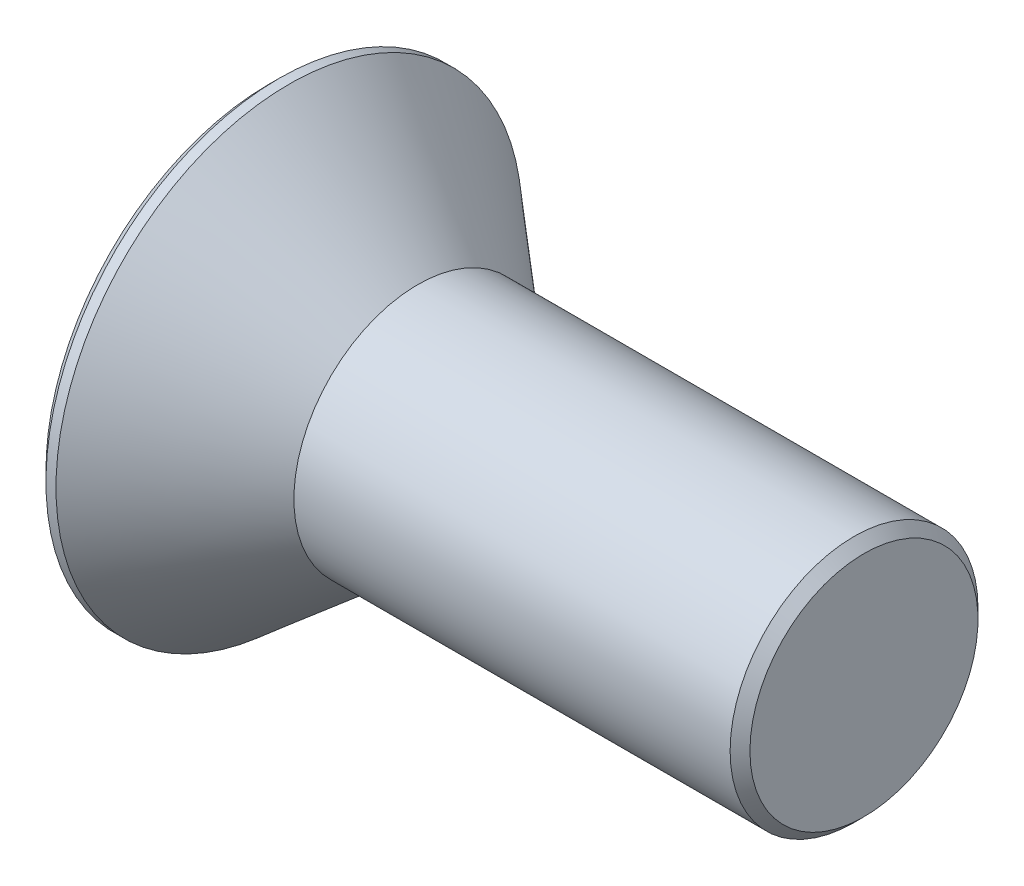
ISO-10303-21;
HEADER;
FILE_DESCRIPTION(('STEP AP214'),'2;1');
FILE_NAME('part.step','',(''),(''),'','','');
FILE_SCHEMA(('AUTOMOTIVE_DESIGN { 1 0 10303 214 1 1 1 1 }'));
ENDSEC;
DATA;
#1=APPLICATION_CONTEXT('core data for automotive mechanical design processes');
#2=APPLICATION_PROTOCOL_DEFINITION('international standard','automotive_design',2000,#1);
#3=PRODUCT_CONTEXT('',#1,'mechanical');
#4=PRODUCT('Part','Part','',(#3));
#5=PRODUCT_RELATED_PRODUCT_CATEGORY('part','',(#4));
#6=PRODUCT_DEFINITION_FORMATION('','',#4);
#7=PRODUCT_DEFINITION_CONTEXT('part definition',#1,'design');
#8=PRODUCT_DEFINITION('design','',#6,#7);
#9=PRODUCT_DEFINITION_SHAPE('','',#8);
#10=(LENGTH_UNIT() NAMED_UNIT(*) SI_UNIT(.MILLI.,.METRE.));
#11=(NAMED_UNIT(*) PLANE_ANGLE_UNIT() SI_UNIT($,.RADIAN.));
#12=(NAMED_UNIT(*) SI_UNIT($,.STERADIAN.) SOLID_ANGLE_UNIT());
#13=UNCERTAINTY_MEASURE_WITH_UNIT(LENGTH_MEASURE(1.E-05),#10,'distance_accuracy_value','');
#14=(GEOMETRIC_REPRESENTATION_CONTEXT(3) GLOBAL_UNCERTAINTY_ASSIGNED_CONTEXT((#13)) GLOBAL_UNIT_ASSIGNED_CONTEXT((#10,
#11,#12)) REPRESENTATION_CONTEXT('',''));
#15=CARTESIAN_POINT('',(0.,0.,0.));
#16=DIRECTION('',(0.,0.,1.));
#17=DIRECTION('',(1.,0.,0.));
#18=AXIS2_PLACEMENT_3D('',#15,#16,#17);
#19=CARTESIAN_POINT('',(1.2,0.,0.));
#20=DIRECTION('',(-1.,0.,0.));
#21=DIRECTION('',(0.,0.,1.));
#22=AXIS2_PLACEMENT_3D('',#19,#20,#21);
#23=PLANE('',#22);
#24=CARTESIAN_POINT('',(1.2,-0.9133974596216,-0.5320508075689));
#25=DIRECTION('',(-1.,0.,0.));
#26=DIRECTION('',(0.,0.,1.));
#27=AXIS2_PLACEMENT_3D('',#24,#25,#26);
#28=CIRCLE('',#27,0.05);
#29=CARTESIAN_POINT('',(1.2,-0.9133974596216,-0.5820508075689));
#30=VERTEX_POINT('',#29);
#31=CARTESIAN_POINT('',(1.2,-0.956698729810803,-0.507050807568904));
#32=VERTEX_POINT('',#31);
#33=EDGE_CURVE('E264',#30,#32,#28,.T.);
#34=ORIENTED_EDGE('',*,*,#33,.T.);
#35=DIRECTION('',(0.,-0.500000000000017,-0.866025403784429));
#36=VECTOR('',#35,1.);
#37=CARTESIAN_POINT('',(1.2,-0.9566987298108,-0.5070508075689));
#38=LINE('',#37,#36);
#39=CARTESIAN_POINT('',(1.2,-0.736121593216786,-0.125000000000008));
#40=VERTEX_POINT('',#39);
#41=EDGE_CURVE('E263',#32,#40,#38,.F.);
#42=ORIENTED_EDGE('',*,*,#41,.T.);
#43=CARTESIAN_POINT('',(1.2,-0.9526279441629,0.));
#44=DIRECTION('',(-1.,0.,0.));
#45=DIRECTION('',(0.,0.,1.));
#46=AXIS2_PLACEMENT_3D('',#43,#44,#45);
#47=CIRCLE('',#46,0.25);
#48=CARTESIAN_POINT('',(1.2,-0.7361215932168,0.125));
#49=VERTEX_POINT('',#48);
#50=EDGE_CURVE('E259',#49,#40,#47,.T.);
#51=ORIENTED_EDGE('',*,*,#50,.F.);
#52=DIRECTION('',(0.,0.500000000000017,-0.866025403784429));
#53=VECTOR('',#52,1.);
#54=CARTESIAN_POINT('',(1.2,-0.7361215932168,0.125));
#55=LINE('',#54,#53);
#56=CARTESIAN_POINT('',(1.2,-0.956698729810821,0.507050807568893));
#57=VERTEX_POINT('',#56);
#58=EDGE_CURVE('E303',#49,#57,#55,.F.);
#59=ORIENTED_EDGE('',*,*,#58,.T.);
#60=CARTESIAN_POINT('',(1.2,-0.9133974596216,0.5320508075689));
#61=DIRECTION('',(-1.,0.,0.));
#62=DIRECTION('',(0.,0.,1.));
#63=AXIS2_PLACEMENT_3D('',#60,#61,#62);
#64=CIRCLE('',#63,0.05);
#65=CARTESIAN_POINT('',(1.2,-0.9133974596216,0.5820508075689));
#66=VERTEX_POINT('',#65);
#67=EDGE_CURVE('E255',#57,#66,#64,.T.);
#68=ORIENTED_EDGE('',*,*,#67,.T.);
#69=DIRECTION('',(0.,1.,0.));
#70=VECTOR('',#69,1.);
#71=CARTESIAN_POINT('',(1.2,-0.9133974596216,0.5820508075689));
#72=LINE('',#71,#70);
#73=CARTESIAN_POINT('',(1.2,-0.4722431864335,0.5820508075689));
#74=VERTEX_POINT('',#73);
#75=EDGE_CURVE('E254',#66,#74,#72,.T.);
#76=ORIENTED_EDGE('',*,*,#75,.T.);
#77=CARTESIAN_POINT('',(1.2,-0.4722431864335,0.8320508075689));
#78=DIRECTION('',(-1.,0.,0.));
#79=DIRECTION('',(0.,0.,1.));
#80=AXIS2_PLACEMENT_3D('',#77,#78,#79);
#81=CIRCLE('',#80,0.25);
#82=CARTESIAN_POINT('',(1.2,-0.2557368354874,0.7070508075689));
#83=VERTEX_POINT('',#82);
#84=EDGE_CURVE('E250',#83,#74,#81,.T.);
#85=ORIENTED_EDGE('',*,*,#84,.F.);
#86=DIRECTION('',(0.,-0.500000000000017,-0.866025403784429));
#87=VECTOR('',#86,1.);
#88=CARTESIAN_POINT('',(1.2,-0.2557368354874,0.7070508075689));
#89=LINE('',#88,#87);
#90=CARTESIAN_POINT('',(1.2,-0.0433012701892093,1.07499999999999));
#91=VERTEX_POINT('',#90);
#92=EDGE_CURVE('E299',#83,#91,#89,.F.);
#93=ORIENTED_EDGE('',*,*,#92,.T.);
#94=CARTESIAN_POINT('',(1.2,0.,1.05));
#95=DIRECTION('',(-1.,0.,0.));
#96=DIRECTION('',(0.,0.,1.));
#97=AXIS2_PLACEMENT_3D('',#94,#95,#96);
#98=CIRCLE('',#97,0.05);
#99=CARTESIAN_POINT('',(1.2,0.04330127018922,1.075));
#100=VERTEX_POINT('',#99);
#101=EDGE_CURVE('E246',#91,#100,#98,.T.);
#102=ORIENTED_EDGE('',*,*,#101,.T.);
#103=DIRECTION('',(0.,-0.500000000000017,0.866025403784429));
#104=VECTOR('',#103,1.);
#105=CARTESIAN_POINT('',(1.2,0.04330127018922,1.075));
#106=LINE('',#105,#104);
#107=CARTESIAN_POINT('',(1.2,0.255736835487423,0.707050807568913));
#108=VERTEX_POINT('',#107);
#109=EDGE_CURVE('E181',#100,#108,#106,.F.);
#110=ORIENTED_EDGE('',*,*,#109,.T.);
#111=CARTESIAN_POINT('',(1.2,0.4722431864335,0.8320508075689));
#112=DIRECTION('',(-1.,0.,0.));
#113=DIRECTION('',(0.,0.,1.));
#114=AXIS2_PLACEMENT_3D('',#111,#112,#113);
#115=CIRCLE('',#114,0.25);
#116=CARTESIAN_POINT('',(1.2,0.4722431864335,0.5820508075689));
#117=VERTEX_POINT('',#116);
#118=EDGE_CURVE('E20',#117,#108,#115,.T.);
#119=ORIENTED_EDGE('',*,*,#118,.F.);
#120=DIRECTION('',(0.,1.,0.));
#121=VECTOR('',#120,1.);
#122=CARTESIAN_POINT('',(1.2,0.4722431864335,0.5820508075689));
#123=LINE('',#122,#121);
#124=CARTESIAN_POINT('',(1.2,0.9133974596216,0.5820508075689));
#125=VERTEX_POINT('',#124);
#126=EDGE_CURVE('E178',#117,#125,#123,.T.);
#127=ORIENTED_EDGE('',*,*,#126,.T.);
#128=CARTESIAN_POINT('',(1.2,0.9133974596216,0.5320508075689));
#129=DIRECTION('',(-1.,0.,0.));
#130=DIRECTION('',(0.,0.,1.));
#131=AXIS2_PLACEMENT_3D('',#128,#129,#130);
#132=CIRCLE('',#131,0.05);
#133=CARTESIAN_POINT('',(1.2,0.956698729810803,0.507050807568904));
#134=VERTEX_POINT('',#133);
#135=EDGE_CURVE('E197',#125,#134,#132,.T.);
#136=ORIENTED_EDGE('',*,*,#135,.T.);
#137=DIRECTION('',(0.,0.500000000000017,0.866025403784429));
#138=VECTOR('',#137,1.);
#139=CARTESIAN_POINT('',(1.2,0.9566987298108,0.5070508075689));
#140=LINE('',#139,#138);
#141=CARTESIAN_POINT('',(1.2,0.736121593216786,0.125000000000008));
#142=VERTEX_POINT('',#141);
#143=EDGE_CURVE('E201',#134,#142,#140,.F.);
#144=ORIENTED_EDGE('',*,*,#143,.T.);
#145=CARTESIAN_POINT('',(1.2,0.9526279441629,0.));
#146=DIRECTION('',(-1.,0.,0.));
#147=DIRECTION('',(0.,0.,1.));
#148=AXIS2_PLACEMENT_3D('',#145,#146,#147);
#149=CIRCLE('',#148,0.25);
#150=CARTESIAN_POINT('',(1.2,0.7361215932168,-0.125));
#151=VERTEX_POINT('',#150);
#152=EDGE_CURVE('E286',#151,#142,#149,.T.);
#153=ORIENTED_EDGE('',*,*,#152,.F.);
#154=DIRECTION('',(0.,-0.500000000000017,0.866025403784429));
#155=VECTOR('',#154,1.);
#156=CARTESIAN_POINT('',(1.2,0.7361215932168,-0.125));
#157=LINE('',#156,#155);
#158=CARTESIAN_POINT('',(1.2,0.956698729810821,-0.507050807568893));
#159=VERTEX_POINT('',#158);
#160=EDGE_CURVE('E314',#151,#159,#157,.F.);
#161=ORIENTED_EDGE('',*,*,#160,.T.);
#162=CARTESIAN_POINT('',(1.2,0.9133974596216,-0.5320508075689));
#163=DIRECTION('',(-1.,0.,0.));
#164=DIRECTION('',(0.,0.,1.));
#165=AXIS2_PLACEMENT_3D('',#162,#163,#164);
#166=CIRCLE('',#165,0.05);
#167=CARTESIAN_POINT('',(1.2,0.9133974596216,-0.5820508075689));
#168=VERTEX_POINT('',#167);
#169=EDGE_CURVE('E282',#159,#168,#166,.T.);
#170=ORIENTED_EDGE('',*,*,#169,.T.);
#171=DIRECTION('',(0.,1.,0.));
#172=VECTOR('',#171,1.);
#173=CARTESIAN_POINT('',(1.2,0.9133974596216,-0.5820508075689));
#174=LINE('',#173,#172);
#175=CARTESIAN_POINT('',(1.2,0.4722431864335,-0.5820508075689));
#176=VERTEX_POINT('',#175);
#177=EDGE_CURVE('E281',#168,#176,#174,.F.);
#178=ORIENTED_EDGE('',*,*,#177,.T.);
#179=CARTESIAN_POINT('',(1.2,0.4722431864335,-0.8320508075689));
#180=DIRECTION('',(-1.,0.,0.));
#181=DIRECTION('',(0.,0.,1.));
#182=AXIS2_PLACEMENT_3D('',#179,#180,#181);
#183=CIRCLE('',#182,0.25);
#184=CARTESIAN_POINT('',(1.2,0.2557368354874,-0.7070508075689));
#185=VERTEX_POINT('',#184);
#186=EDGE_CURVE('E277',#185,#176,#183,.T.);
#187=ORIENTED_EDGE('',*,*,#186,.F.);
#188=DIRECTION('',(0.,0.500000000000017,0.866025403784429));
#189=VECTOR('',#188,1.);
#190=CARTESIAN_POINT('',(1.2,0.2557368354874,-0.7070508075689));
#191=LINE('',#190,#189);
#192=CARTESIAN_POINT('',(1.2,0.0433012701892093,-1.07499999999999));
#193=VERTEX_POINT('',#192);
#194=EDGE_CURVE('E311',#185,#193,#191,.F.);
#195=ORIENTED_EDGE('',*,*,#194,.T.);
#196=CARTESIAN_POINT('',(1.2,0.,-1.05));
#197=DIRECTION('',(-1.,0.,0.));
#198=DIRECTION('',(0.,0.,1.));
#199=AXIS2_PLACEMENT_3D('',#196,#197,#198);
#200=CIRCLE('',#199,0.05);
#201=CARTESIAN_POINT('',(1.2,-0.04330127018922,-1.075));
#202=VERTEX_POINT('',#201);
#203=EDGE_CURVE('E273',#193,#202,#200,.T.);
#204=ORIENTED_EDGE('',*,*,#203,.T.);
#205=DIRECTION('',(0.,0.500000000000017,-0.866025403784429));
#206=VECTOR('',#205,1.);
#207=CARTESIAN_POINT('',(1.2,-0.04330127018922,-1.075));
#208=LINE('',#207,#206);
#209=CARTESIAN_POINT('',(1.2,-0.255736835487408,-0.707050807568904));
#210=VERTEX_POINT('',#209);
#211=EDGE_CURVE('E272',#202,#210,#208,.F.);
#212=ORIENTED_EDGE('',*,*,#211,.T.);
#213=CARTESIAN_POINT('',(1.2,-0.4722431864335,-0.8320508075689));
#214=DIRECTION('',(-1.,0.,0.));
#215=DIRECTION('',(0.,0.,1.));
#216=AXIS2_PLACEMENT_3D('',#213,#214,#215);
#217=CIRCLE('',#216,0.25);
#218=CARTESIAN_POINT('',(1.2,-0.4722431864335,-0.5820508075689));
#219=VERTEX_POINT('',#218);
#220=EDGE_CURVE('E268',#219,#210,#217,.T.);
#221=ORIENTED_EDGE('',*,*,#220,.F.);
#222=DIRECTION('',(0.,1.,0.));
#223=VECTOR('',#222,1.);
#224=CARTESIAN_POINT('',(1.2,-0.4722431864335,-0.5820508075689));
#225=LINE('',#224,#223);
#226=EDGE_CURVE('E307',#219,#30,#225,.F.);
#227=ORIENTED_EDGE('',*,*,#226,.T.);
#228=EDGE_LOOP('',(#34,#42,#51,#59,#68,#76,#85,#93,#102,#110,#119,#127,#136,#144,#153,#161,#170,
#178,#187,#195,#204,#212,#221,#227));
#229=FACE_BOUND('',#228,.T.);
#230=ADVANCED_FACE('F17',(#229),#23,.T.);
#231=CARTESIAN_POINT('',(0.,0.4722431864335,0.8320508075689));
#232=DIRECTION('',(-1.,0.,0.));
#233=DIRECTION('',(0.,0.,1.));
#234=AXIS2_PLACEMENT_3D('',#231,#232,#233);
#235=CYLINDRICAL_SURFACE('',#234,0.25);
#236=ORIENTED_EDGE('',*,*,#118,.T.);
#237=DIRECTION('',(1.,0.,0.));
#238=VECTOR('',#237,1.);
#239=CARTESIAN_POINT('',(0.,0.255736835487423,0.707050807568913));
#240=LINE('',#239,#238);
#241=CARTESIAN_POINT('',(0.,0.255736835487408,0.707050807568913));
#242=VERTEX_POINT('',#241);
#243=EDGE_CURVE('E245',#108,#242,#240,.F.);
#244=ORIENTED_EDGE('',*,*,#243,.T.);
#245=CARTESIAN_POINT('',(0.,0.4722431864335,0.8320508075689));
#246=DIRECTION('',(-1.,0.,0.));
#247=DIRECTION('',(0.,0.,1.));
#248=AXIS2_PLACEMENT_3D('',#245,#246,#247);
#249=CIRCLE('',#248,0.25);
#250=CARTESIAN_POINT('',(0.,0.4722431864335,0.5820508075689));
#251=VERTEX_POINT('',#250);
#252=EDGE_CURVE('E188',#242,#251,#249,.F.);
#253=ORIENTED_EDGE('',*,*,#252,.T.);
#254=DIRECTION('',(1.,0.,0.));
#255=VECTOR('',#254,1.);
#256=CARTESIAN_POINT('',(0.,0.4722431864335,0.5820508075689));
#257=LINE('',#256,#255);
#258=EDGE_CURVE('E184',#251,#117,#257,.T.);
#259=ORIENTED_EDGE('',*,*,#258,.T.);
#260=EDGE_LOOP('',(#236,#244,#253,#259));
#261=FACE_BOUND('',#260,.T.);
#262=ADVANCED_FACE('F186',(#261),#235,.T.);
#263=CARTESIAN_POINT('',(0.,0.4722431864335,0.5820508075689));
#264=DIRECTION('',(0.,0.,1.));
#265=DIRECTION('',(1.,0.,0.));
#266=AXIS2_PLACEMENT_3D('',#263,#264,#265);
#267=PLANE('',#266);
#268=DIRECTION('',(-1.,0.,0.));
#269=VECTOR('',#268,1.);
#270=CARTESIAN_POINT('',(0.,0.9133974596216,0.5820508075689));
#271=LINE('',#270,#269);
#272=CARTESIAN_POINT('',(0.,0.9133974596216,0.5820508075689));
#273=VERTEX_POINT('',#272);
#274=EDGE_CURVE('E194',#273,#125,#271,.F.);
#275=ORIENTED_EDGE('',*,*,#274,.T.);
#276=ORIENTED_EDGE('',*,*,#126,.F.);
#277=ORIENTED_EDGE('',*,*,#258,.F.);
#278=DIRECTION('',(0.,1.,0.));
#279=VECTOR('',#278,1.);
#280=CARTESIAN_POINT('',(0.,0.,0.5820508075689));
#281=LINE('',#280,#279);
#282=EDGE_CURVE('E243',#251,#273,#281,.T.);
#283=ORIENTED_EDGE('',*,*,#282,.T.);
#284=EDGE_LOOP('',(#275,#276,#277,#283));
#285=FACE_BOUND('',#284,.T.);
#286=ADVANCED_FACE('F192',(#285),#267,.F.);
#287=CARTESIAN_POINT('',(0.,0.9133974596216,0.5320508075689));
#288=DIRECTION('',(-1.,0.,0.));
#289=DIRECTION('',(0.,0.,1.));
#290=AXIS2_PLACEMENT_3D('',#287,#288,#289);
#291=CYLINDRICAL_SURFACE('',#290,0.05);
#292=DIRECTION('',(1.,0.,0.));
#293=VECTOR('',#292,1.);
#294=CARTESIAN_POINT('',(0.,0.9566987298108,0.5070508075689));
#295=LINE('',#294,#293);
#296=CARTESIAN_POINT('',(0.,0.956698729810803,0.507050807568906));
#297=VERTEX_POINT('',#296);
#298=EDGE_CURVE('E289',#297,#134,#295,.T.);
#299=ORIENTED_EDGE('',*,*,#298,.T.);
#300=ORIENTED_EDGE('',*,*,#135,.F.);
#301=ORIENTED_EDGE('',*,*,#274,.F.);
#302=CARTESIAN_POINT('',(0.,0.9133974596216,0.5320508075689));
#303=DIRECTION('',(-1.,0.,0.));
#304=DIRECTION('',(0.,0.,1.));
#305=AXIS2_PLACEMENT_3D('',#302,#303,#304);
#306=CIRCLE('',#305,0.05);
#307=EDGE_CURVE('E241',#273,#297,#306,.T.);
#308=ORIENTED_EDGE('',*,*,#307,.T.);
#309=EDGE_LOOP('',(#299,#300,#301,#308));
#310=FACE_BOUND('',#309,.T.);
#311=ADVANCED_FACE('F515',(#310),#291,.F.);
#312=CARTESIAN_POINT('',(0.,0.9566987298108,0.5070508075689));
#313=DIRECTION('',(0.,0.866025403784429,-0.500000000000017));
#314=DIRECTION('',(0.,0.500000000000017,0.866025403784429));
#315=AXIS2_PLACEMENT_3D('',#312,#313,#314);
#316=PLANE('',#315);
#317=DIRECTION('',(-1.,0.,0.));
#318=VECTOR('',#317,1.);
#319=CARTESIAN_POINT('',(0.,0.736121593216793,0.125000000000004));
#320=LINE('',#319,#318);
#321=CARTESIAN_POINT('',(0.,0.736121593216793,0.124999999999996));
#322=VERTEX_POINT('',#321);
#323=EDGE_CURVE('E288',#142,#322,#320,.T.);
#324=ORIENTED_EDGE('',*,*,#323,.F.);
#325=ORIENTED_EDGE('',*,*,#143,.F.);
#326=ORIENTED_EDGE('',*,*,#298,.F.);
#327=DIRECTION('',(0.,-0.499999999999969,-0.866025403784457));
#328=VECTOR('',#327,1.);
#329=CARTESIAN_POINT('',(0.,0.9566987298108,0.5070508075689));
#330=LINE('',#329,#328);
#331=EDGE_CURVE('E240',#297,#322,#330,.T.);
#332=ORIENTED_EDGE('',*,*,#331,.T.);
#333=EDGE_LOOP('',(#324,#325,#326,#332));
#334=FACE_BOUND('',#333,.T.);
#335=ADVANCED_FACE('F512',(#334),#316,.F.);
#336=CARTESIAN_POINT('',(0.,0.9526279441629,0.));
#337=DIRECTION('',(-1.,0.,0.));
#338=DIRECTION('',(0.,0.,1.));
#339=AXIS2_PLACEMENT_3D('',#336,#337,#338);
#340=CYLINDRICAL_SURFACE('',#339,0.25);
#341=ORIENTED_EDGE('',*,*,#152,.T.);
#342=ORIENTED_EDGE('',*,*,#323,.T.);
#343=CARTESIAN_POINT('',(0.,0.9526279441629,0.));
#344=DIRECTION('',(-1.,0.,0.));
#345=DIRECTION('',(0.,0.,1.));
#346=AXIS2_PLACEMENT_3D('',#343,#344,#345);
#347=CIRCLE('',#346,0.25);
#348=CARTESIAN_POINT('',(0.,0.736121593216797,-0.124999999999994));
#349=VERTEX_POINT('',#348);
#350=EDGE_CURVE('E238',#322,#349,#347,.F.);
#351=ORIENTED_EDGE('',*,*,#350,.T.);
#352=DIRECTION('',(1.,0.,0.));
#353=VECTOR('',#352,1.);
#354=CARTESIAN_POINT('',(0.,0.7361215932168,-0.125));
#355=LINE('',#354,#353);
#356=EDGE_CURVE('E315',#349,#151,#355,.T.);
#357=ORIENTED_EDGE('',*,*,#356,.T.);
#358=EDGE_LOOP('',(#341,#342,#351,#357));
#359=FACE_BOUND('',#358,.T.);
#360=ADVANCED_FACE('F508',(#359),#340,.T.);
#361=CARTESIAN_POINT('',(0.,0.7361215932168,-0.125));
#362=DIRECTION('',(0.,0.866025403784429,0.500000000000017));
#363=DIRECTION('',(0.,-0.500000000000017,0.866025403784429));
#364=AXIS2_PLACEMENT_3D('',#361,#362,#363);
#365=PLANE('',#364);
#366=DIRECTION('',(-1.,0.,0.));
#367=VECTOR('',#366,1.);
#368=CARTESIAN_POINT('',(0.,0.956698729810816,-0.50705080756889));
#369=LINE('',#368,#367);
#370=CARTESIAN_POINT('',(0.,0.956698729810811,-0.507050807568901));
#371=VERTEX_POINT('',#370);
#372=EDGE_CURVE('E285',#371,#159,#369,.F.);
#373=ORIENTED_EDGE('',*,*,#372,.T.);
#374=ORIENTED_EDGE('',*,*,#160,.F.);
#375=ORIENTED_EDGE('',*,*,#356,.F.);
#376=DIRECTION('',(0.,0.499999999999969,-0.866025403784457));
#377=VECTOR('',#376,1.);
#378=CARTESIAN_POINT('',(0.,0.7361215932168,-0.125));
#379=LINE('',#378,#377);
#380=EDGE_CURVE('E237',#349,#371,#379,.T.);
#381=ORIENTED_EDGE('',*,*,#380,.T.);
#382=EDGE_LOOP('',(#373,#374,#375,#381));
#383=FACE_BOUND('',#382,.T.);
#384=ADVANCED_FACE('F504',(#383),#365,.F.);
#385=CARTESIAN_POINT('',(0.,0.9133974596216,-0.5320508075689));
#386=DIRECTION('',(-1.,0.,0.));
#387=DIRECTION('',(0.,0.,1.));
#388=AXIS2_PLACEMENT_3D('',#385,#386,#387);
#389=CYLINDRICAL_SURFACE('',#388,0.05);
#390=DIRECTION('',(-1.,0.,0.));
#391=VECTOR('',#390,1.);
#392=CARTESIAN_POINT('',(0.,0.9133974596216,-0.5820508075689));
#393=LINE('',#392,#391);
#394=CARTESIAN_POINT('',(0.,0.9133974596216,-0.5820508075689));
#395=VERTEX_POINT('',#394);
#396=EDGE_CURVE('E284',#395,#168,#393,.F.);
#397=ORIENTED_EDGE('',*,*,#396,.T.);
#398=ORIENTED_EDGE('',*,*,#169,.F.);
#399=ORIENTED_EDGE('',*,*,#372,.F.);
#400=CARTESIAN_POINT('',(0.,0.9133974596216,-0.5320508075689));
#401=DIRECTION('',(-1.,0.,0.));
#402=DIRECTION('',(0.,0.,1.));
#403=AXIS2_PLACEMENT_3D('',#400,#401,#402);
#404=CIRCLE('',#403,0.05);
#405=EDGE_CURVE('E235',#371,#395,#404,.T.);
#406=ORIENTED_EDGE('',*,*,#405,.T.);
#407=EDGE_LOOP('',(#397,#398,#399,#406));
#408=FACE_BOUND('',#407,.T.);
#409=ADVANCED_FACE('F500',(#408),#389,.F.);
#410=CARTESIAN_POINT('',(0.,0.9133974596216,-0.5820508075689));
#411=DIRECTION('',(0.,0.,-1.));
#412=DIRECTION('',(-1.,0.,0.));
#413=AXIS2_PLACEMENT_3D('',#410,#411,#412);
#414=PLANE('',#413);
#415=DIRECTION('',(-1.,0.,0.));
#416=VECTOR('',#415,1.);
#417=CARTESIAN_POINT('',(0.,0.4722431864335,-0.5820508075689));
#418=LINE('',#417,#416);
#419=CARTESIAN_POINT('',(0.,0.4722431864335,-0.5820508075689));
#420=VERTEX_POINT('',#419);
#421=EDGE_CURVE('E280',#176,#420,#418,.T.);
#422=ORIENTED_EDGE('',*,*,#421,.F.);
#423=ORIENTED_EDGE('',*,*,#177,.F.);
#424=ORIENTED_EDGE('',*,*,#396,.F.);
#425=DIRECTION('',(0.,1.,0.));
#426=VECTOR('',#425,1.);
#427=CARTESIAN_POINT('',(0.,0.,-0.5820508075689));
#428=LINE('',#427,#426);
#429=EDGE_CURVE('E234',#395,#420,#428,.F.);
#430=ORIENTED_EDGE('',*,*,#429,.T.);
#431=EDGE_LOOP('',(#422,#423,#424,#430));
#432=FACE_BOUND('',#431,.T.);
#433=ADVANCED_FACE('F496',(#432),#414,.F.);
#434=CARTESIAN_POINT('',(0.,0.4722431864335,-0.8320508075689));
#435=DIRECTION('',(-1.,0.,0.));
#436=DIRECTION('',(0.,0.,1.));
#437=AXIS2_PLACEMENT_3D('',#434,#435,#436);
#438=CYLINDRICAL_SURFACE('',#437,0.25);
#439=ORIENTED_EDGE('',*,*,#186,.T.);
#440=ORIENTED_EDGE('',*,*,#421,.T.);
#441=CARTESIAN_POINT('',(0.,0.4722431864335,-0.8320508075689));
#442=DIRECTION('',(-1.,0.,0.));
#443=DIRECTION('',(0.,0.,1.));
#444=AXIS2_PLACEMENT_3D('',#441,#442,#443);
#445=CIRCLE('',#444,0.25);
#446=CARTESIAN_POINT('',(0.,0.255736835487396,-0.707050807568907));
#447=VERTEX_POINT('',#446);
#448=EDGE_CURVE('E232',#420,#447,#445,.F.);
#449=ORIENTED_EDGE('',*,*,#448,.T.);
#450=DIRECTION('',(1.,0.,0.));
#451=VECTOR('',#450,1.);
#452=CARTESIAN_POINT('',(0.,0.2557368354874,-0.7070508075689));
#453=LINE('',#452,#451);
#454=EDGE_CURVE('E313',#447,#185,#453,.T.);
#455=ORIENTED_EDGE('',*,*,#454,.T.);
#456=EDGE_LOOP('',(#439,#440,#449,#455));
#457=FACE_BOUND('',#456,.T.);
#458=ADVANCED_FACE('F492',(#457),#438,.T.);
#459=CARTESIAN_POINT('',(0.,0.2557368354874,-0.7070508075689));
#460=DIRECTION('',(0.,0.866025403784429,-0.500000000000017));
#461=DIRECTION('',(0.,0.500000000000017,0.866025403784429));
#462=AXIS2_PLACEMENT_3D('',#459,#460,#461);
#463=PLANE('',#462);
#464=DIRECTION('',(-1.,0.,0.));
#465=VECTOR('',#464,1.);
#466=CARTESIAN_POINT('',(0.,0.0433012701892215,-1.075));
#467=LINE('',#466,#465);
#468=CARTESIAN_POINT('',(0.,0.0433012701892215,-1.075));
#469=VERTEX_POINT('',#468);
#470=EDGE_CURVE('E276',#469,#193,#467,.F.);
#471=ORIENTED_EDGE('',*,*,#470,.T.);
#472=ORIENTED_EDGE('',*,*,#194,.F.);
#473=ORIENTED_EDGE('',*,*,#454,.F.);
#474=DIRECTION('',(0.,-0.499999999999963,-0.86602540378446));
#475=VECTOR('',#474,1.);
#476=CARTESIAN_POINT('',(0.,0.2557368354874,-0.7070508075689));
#477=LINE('',#476,#475);
#478=EDGE_CURVE('E231',#447,#469,#477,.T.);
#479=ORIENTED_EDGE('',*,*,#478,.T.);
#480=EDGE_LOOP('',(#471,#472,#473,#479));
#481=FACE_BOUND('',#480,.T.);
#482=ADVANCED_FACE('F488',(#481),#463,.F.);
#483=CARTESIAN_POINT('',(0.,0.,-1.05));
#484=DIRECTION('',(-1.,0.,0.));
#485=DIRECTION('',(0.,0.,1.));
#486=AXIS2_PLACEMENT_3D('',#483,#484,#485);
#487=CYLINDRICAL_SURFACE('',#486,0.05);
#488=DIRECTION('',(1.,0.,0.));
#489=VECTOR('',#488,1.);
#490=CARTESIAN_POINT('',(0.,-0.04330127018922,-1.075));
#491=LINE('',#490,#489);
#492=CARTESIAN_POINT('',(0.,-0.0433012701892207,-1.075));
#493=VERTEX_POINT('',#492);
#494=EDGE_CURVE('E275',#493,#202,#491,.T.);
#495=ORIENTED_EDGE('',*,*,#494,.T.);
#496=ORIENTED_EDGE('',*,*,#203,.F.);
#497=ORIENTED_EDGE('',*,*,#470,.F.);
#498=CARTESIAN_POINT('',(0.,0.,-1.05));
#499=DIRECTION('',(-1.,0.,0.));
#500=DIRECTION('',(0.,0.,1.));
#501=AXIS2_PLACEMENT_3D('',#498,#499,#500);
#502=CIRCLE('',#501,0.05);
#503=EDGE_CURVE('E229',#469,#493,#502,.T.);
#504=ORIENTED_EDGE('',*,*,#503,.T.);
#505=EDGE_LOOP('',(#495,#496,#497,#504));
#506=FACE_BOUND('',#505,.T.);
#507=ADVANCED_FACE('F484',(#506),#487,.F.);
#508=CARTESIAN_POINT('',(0.,-0.04330127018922,-1.075));
#509=DIRECTION('',(0.,-0.866025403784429,-0.500000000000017));
#510=DIRECTION('',(0.,0.500000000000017,-0.866025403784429));
#511=AXIS2_PLACEMENT_3D('',#508,#509,#510);
#512=PLANE('',#511);
#513=DIRECTION('',(-1.,0.,0.));
#514=VECTOR('',#513,1.);
#515=CARTESIAN_POINT('',(0.,-0.255736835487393,-0.707050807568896));
#516=LINE('',#515,#514);
#517=CARTESIAN_POINT('',(0.,-0.255736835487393,-0.707050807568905));
#518=VERTEX_POINT('',#517);
#519=EDGE_CURVE('E271',#210,#518,#516,.T.);
#520=ORIENTED_EDGE('',*,*,#519,.F.);
#521=ORIENTED_EDGE('',*,*,#211,.F.);
#522=ORIENTED_EDGE('',*,*,#494,.F.);
#523=DIRECTION('',(0.,-0.499999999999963,0.86602540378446));
#524=VECTOR('',#523,1.);
#525=CARTESIAN_POINT('',(0.,-0.04330127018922,-1.075));
#526=LINE('',#525,#524);
#527=EDGE_CURVE('E228',#493,#518,#526,.T.);
#528=ORIENTED_EDGE('',*,*,#527,.T.);
#529=EDGE_LOOP('',(#520,#521,#522,#528));
#530=FACE_BOUND('',#529,.T.);
#531=ADVANCED_FACE('F480',(#530),#512,.F.);
#532=CARTESIAN_POINT('',(0.,-0.4722431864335,-0.8320508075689));
#533=DIRECTION('',(-1.,0.,0.));
#534=DIRECTION('',(0.,0.,1.));
#535=AXIS2_PLACEMENT_3D('',#532,#533,#534);
#536=CYLINDRICAL_SURFACE('',#535,0.25);
#537=ORIENTED_EDGE('',*,*,#220,.T.);
#538=ORIENTED_EDGE('',*,*,#519,.T.);
#539=CARTESIAN_POINT('',(0.,-0.4722431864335,-0.8320508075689));
#540=DIRECTION('',(-1.,0.,0.));
#541=DIRECTION('',(0.,0.,1.));
#542=AXIS2_PLACEMENT_3D('',#539,#540,#541);
#543=CIRCLE('',#542,0.25);
#544=CARTESIAN_POINT('',(0.,-0.4722431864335,-0.5820508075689));
#545=VERTEX_POINT('',#544);
#546=EDGE_CURVE('E226',#518,#545,#543,.F.);
#547=ORIENTED_EDGE('',*,*,#546,.T.);
#548=DIRECTION('',(-1.,0.,0.));
#549=VECTOR('',#548,1.);
#550=CARTESIAN_POINT('',(0.,-0.4722431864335,-0.5820508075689));
#551=LINE('',#550,#549);
#552=EDGE_CURVE('E309',#545,#219,#551,.F.);
#553=ORIENTED_EDGE('',*,*,#552,.T.);
#554=EDGE_LOOP('',(#537,#538,#547,#553));
#555=FACE_BOUND('',#554,.T.);
#556=ADVANCED_FACE('F476',(#555),#536,.T.);
#557=CARTESIAN_POINT('',(0.,-0.4722431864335,-0.5820508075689));
#558=DIRECTION('',(0.,0.,-1.));
#559=DIRECTION('',(-1.,0.,0.));
#560=AXIS2_PLACEMENT_3D('',#557,#558,#559);
#561=PLANE('',#560);
#562=DIRECTION('',(-1.,0.,0.));
#563=VECTOR('',#562,1.);
#564=CARTESIAN_POINT('',(0.,-0.9133974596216,-0.5820508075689));
#565=LINE('',#564,#563);
#566=CARTESIAN_POINT('',(0.,-0.9133974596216,-0.5820508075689));
#567=VERTEX_POINT('',#566);
#568=EDGE_CURVE('E267',#567,#30,#565,.F.);
#569=ORIENTED_EDGE('',*,*,#568,.T.);
#570=ORIENTED_EDGE('',*,*,#226,.F.);
#571=ORIENTED_EDGE('',*,*,#552,.F.);
#572=DIRECTION('',(0.,1.,0.));
#573=VECTOR('',#572,1.);
#574=CARTESIAN_POINT('',(0.,0.,-0.5820508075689));
#575=LINE('',#574,#573);
#576=EDGE_CURVE('E225',#545,#567,#575,.F.);
#577=ORIENTED_EDGE('',*,*,#576,.T.);
#578=EDGE_LOOP('',(#569,#570,#571,#577));
#579=FACE_BOUND('',#578,.T.);
#580=ADVANCED_FACE('F472',(#579),#561,.F.);
#581=CARTESIAN_POINT('',(0.,-0.9133974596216,-0.5320508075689));
#582=DIRECTION('',(-1.,0.,0.));
#583=DIRECTION('',(0.,0.,1.));
#584=AXIS2_PLACEMENT_3D('',#581,#582,#583);
#585=CYLINDRICAL_SURFACE('',#584,0.05);
#586=DIRECTION('',(1.,0.,0.));
#587=VECTOR('',#586,1.);
#588=CARTESIAN_POINT('',(0.,-0.9566987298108,-0.5070508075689));
#589=LINE('',#588,#587);
#590=CARTESIAN_POINT('',(0.,-0.956698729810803,-0.507050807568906));
#591=VERTEX_POINT('',#590);
#592=EDGE_CURVE('E266',#591,#32,#589,.T.);
#593=ORIENTED_EDGE('',*,*,#592,.T.);
#594=ORIENTED_EDGE('',*,*,#33,.F.);
#595=ORIENTED_EDGE('',*,*,#568,.F.);
#596=CARTESIAN_POINT('',(0.,-0.9133974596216,-0.5320508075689));
#597=DIRECTION('',(-1.,0.,0.));
#598=DIRECTION('',(0.,0.,1.));
#599=AXIS2_PLACEMENT_3D('',#596,#597,#598);
#600=CIRCLE('',#599,0.05);
#601=EDGE_CURVE('E223',#567,#591,#600,.T.);
#602=ORIENTED_EDGE('',*,*,#601,.T.);
#603=EDGE_LOOP('',(#593,#594,#595,#602));
#604=FACE_BOUND('',#603,.T.);
#605=ADVANCED_FACE('F468',(#604),#585,.F.);
#606=CARTESIAN_POINT('',(0.,-0.9566987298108,-0.5070508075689));
#607=DIRECTION('',(0.,-0.866025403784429,0.500000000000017));
#608=DIRECTION('',(0.,-0.500000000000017,-0.866025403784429));
#609=AXIS2_PLACEMENT_3D('',#606,#607,#608);
#610=PLANE('',#609);
#611=DIRECTION('',(-1.,0.,0.));
#612=VECTOR('',#611,1.);
#613=CARTESIAN_POINT('',(0.,-0.736121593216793,-0.125000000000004));
#614=LINE('',#613,#612);
#615=CARTESIAN_POINT('',(0.,-0.736121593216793,-0.124999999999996));
#616=VERTEX_POINT('',#615);
#617=EDGE_CURVE('E262',#40,#616,#614,.T.);
#618=ORIENTED_EDGE('',*,*,#617,.F.);
#619=ORIENTED_EDGE('',*,*,#41,.F.);
#620=ORIENTED_EDGE('',*,*,#592,.F.);
#621=DIRECTION('',(0.,0.499999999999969,0.866025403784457));
#622=VECTOR('',#621,1.);
#623=CARTESIAN_POINT('',(0.,-0.9566987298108,-0.5070508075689));
#624=LINE('',#623,#622);
#625=EDGE_CURVE('E222',#591,#616,#624,.T.);
#626=ORIENTED_EDGE('',*,*,#625,.T.);
#627=EDGE_LOOP('',(#618,#619,#620,#626));
#628=FACE_BOUND('',#627,.T.);
#629=ADVANCED_FACE('F464',(#628),#610,.F.);
#630=CARTESIAN_POINT('',(0.,-0.9526279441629,0.));
#631=DIRECTION('',(-1.,0.,0.));
#632=DIRECTION('',(0.,0.,1.));
#633=AXIS2_PLACEMENT_3D('',#630,#631,#632);
#634=CYLINDRICAL_SURFACE('',#633,0.25);
#635=ORIENTED_EDGE('',*,*,#50,.T.);
#636=ORIENTED_EDGE('',*,*,#617,.T.);
#637=CARTESIAN_POINT('',(0.,-0.9526279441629,0.));
#638=DIRECTION('',(-1.,0.,0.));
#639=DIRECTION('',(0.,0.,1.));
#640=AXIS2_PLACEMENT_3D('',#637,#638,#639);
#641=CIRCLE('',#640,0.25);
#642=CARTESIAN_POINT('',(0.,-0.736121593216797,0.124999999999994));
#643=VERTEX_POINT('',#642);
#644=EDGE_CURVE('E220',#616,#643,#641,.F.);
#645=ORIENTED_EDGE('',*,*,#644,.T.);
#646=DIRECTION('',(1.,0.,0.));
#647=VECTOR('',#646,1.);
#648=CARTESIAN_POINT('',(0.,-0.7361215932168,0.125));
#649=LINE('',#648,#647);
#650=EDGE_CURVE('E305',#643,#49,#649,.T.);
#651=ORIENTED_EDGE('',*,*,#650,.T.);
#652=EDGE_LOOP('',(#635,#636,#645,#651));
#653=FACE_BOUND('',#652,.T.);
#654=ADVANCED_FACE('F460',(#653),#634,.T.);
#655=CARTESIAN_POINT('',(0.,-0.7361215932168,0.125));
#656=DIRECTION('',(0.,-0.866025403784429,-0.500000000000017));
#657=DIRECTION('',(0.,0.500000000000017,-0.866025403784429));
#658=AXIS2_PLACEMENT_3D('',#655,#656,#657);
#659=PLANE('',#658);
#660=DIRECTION('',(-1.,0.,0.));
#661=VECTOR('',#660,1.);
#662=CARTESIAN_POINT('',(0.,-0.956698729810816,0.50705080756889));
#663=LINE('',#662,#661);
#664=CARTESIAN_POINT('',(0.,-0.956698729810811,0.507050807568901));
#665=VERTEX_POINT('',#664);
#666=EDGE_CURVE('E258',#665,#57,#663,.F.);
#667=ORIENTED_EDGE('',*,*,#666,.T.);
#668=ORIENTED_EDGE('',*,*,#58,.F.);
#669=ORIENTED_EDGE('',*,*,#650,.F.);
#670=DIRECTION('',(0.,-0.499999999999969,0.866025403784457));
#671=VECTOR('',#670,1.);
#672=CARTESIAN_POINT('',(0.,-0.7361215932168,0.125));
#673=LINE('',#672,#671);
#674=EDGE_CURVE('E219',#643,#665,#673,.T.);
#675=ORIENTED_EDGE('',*,*,#674,.T.);
#676=EDGE_LOOP('',(#667,#668,#669,#675));
#677=FACE_BOUND('',#676,.T.);
#678=ADVANCED_FACE('F456',(#677),#659,.F.);
#679=CARTESIAN_POINT('',(0.,-0.9133974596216,0.5320508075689));
#680=DIRECTION('',(-1.,0.,0.));
#681=DIRECTION('',(0.,0.,1.));
#682=AXIS2_PLACEMENT_3D('',#679,#680,#681);
#683=CYLINDRICAL_SURFACE('',#682,0.05);
#684=DIRECTION('',(1.,0.,0.));
#685=VECTOR('',#684,1.);
#686=CARTESIAN_POINT('',(0.,-0.9133974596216,0.5820508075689));
#687=LINE('',#686,#685);
#688=CARTESIAN_POINT('',(0.,-0.9133974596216,0.5820508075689));
#689=VERTEX_POINT('',#688);
#690=EDGE_CURVE('E257',#689,#66,#687,.T.);
#691=ORIENTED_EDGE('',*,*,#690,.T.);
#692=ORIENTED_EDGE('',*,*,#67,.F.);
#693=ORIENTED_EDGE('',*,*,#666,.F.);
#694=CARTESIAN_POINT('',(0.,-0.9133974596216,0.5320508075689));
#695=DIRECTION('',(-1.,0.,0.));
#696=DIRECTION('',(0.,0.,1.));
#697=AXIS2_PLACEMENT_3D('',#694,#695,#696);
#698=CIRCLE('',#697,0.05);
#699=EDGE_CURVE('E217',#665,#689,#698,.T.);
#700=ORIENTED_EDGE('',*,*,#699,.T.);
#701=EDGE_LOOP('',(#691,#692,#693,#700));
#702=FACE_BOUND('',#701,.T.);
#703=ADVANCED_FACE('F452',(#702),#683,.F.);
#704=CARTESIAN_POINT('',(0.,-0.9133974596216,0.5820508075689));
#705=DIRECTION('',(0.,0.,1.));
#706=DIRECTION('',(1.,0.,0.));
#707=AXIS2_PLACEMENT_3D('',#704,#705,#706);
#708=PLANE('',#707);
#709=DIRECTION('',(-1.,0.,0.));
#710=VECTOR('',#709,1.);
#711=CARTESIAN_POINT('',(0.,-0.4722431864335,0.5820508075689));
#712=LINE('',#711,#710);
#713=CARTESIAN_POINT('',(0.,-0.4722431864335,0.5820508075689));
#714=VERTEX_POINT('',#713);
#715=EDGE_CURVE('E253',#74,#714,#712,.T.);
#716=ORIENTED_EDGE('',*,*,#715,.F.);
#717=ORIENTED_EDGE('',*,*,#75,.F.);
#718=ORIENTED_EDGE('',*,*,#690,.F.);
#719=DIRECTION('',(0.,1.,0.));
#720=VECTOR('',#719,1.);
#721=CARTESIAN_POINT('',(0.,0.,0.5820508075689));
#722=LINE('',#721,#720);
#723=EDGE_CURVE('E216',#689,#714,#722,.T.);
#724=ORIENTED_EDGE('',*,*,#723,.T.);
#725=EDGE_LOOP('',(#716,#717,#718,#724));
#726=FACE_BOUND('',#725,.T.);
#727=ADVANCED_FACE('F448',(#726),#708,.F.);
#728=CARTESIAN_POINT('',(0.,-0.4722431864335,0.8320508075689));
#729=DIRECTION('',(-1.,0.,0.));
#730=DIRECTION('',(0.,0.,1.));
#731=AXIS2_PLACEMENT_3D('',#728,#729,#730);
#732=CYLINDRICAL_SURFACE('',#731,0.25);
#733=ORIENTED_EDGE('',*,*,#84,.T.);
#734=ORIENTED_EDGE('',*,*,#715,.T.);
#735=CARTESIAN_POINT('',(0.,-0.4722431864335,0.8320508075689));
#736=DIRECTION('',(-1.,0.,0.));
#737=DIRECTION('',(0.,0.,1.));
#738=AXIS2_PLACEMENT_3D('',#735,#736,#737);
#739=CIRCLE('',#738,0.25);
#740=CARTESIAN_POINT('',(0.,-0.255736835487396,0.707050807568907));
#741=VERTEX_POINT('',#740);
#742=EDGE_CURVE('E214',#714,#741,#739,.F.);
#743=ORIENTED_EDGE('',*,*,#742,.T.);
#744=DIRECTION('',(1.,0.,0.));
#745=VECTOR('',#744,1.);
#746=CARTESIAN_POINT('',(0.,-0.2557368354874,0.7070508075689));
#747=LINE('',#746,#745);
#748=EDGE_CURVE('E301',#741,#83,#747,.T.);
#749=ORIENTED_EDGE('',*,*,#748,.T.);
#750=EDGE_LOOP('',(#733,#734,#743,#749));
#751=FACE_BOUND('',#750,.T.);
#752=ADVANCED_FACE('F444',(#751),#732,.T.);
#753=CARTESIAN_POINT('',(0.,-0.2557368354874,0.7070508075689));
#754=DIRECTION('',(0.,-0.866025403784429,0.500000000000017));
#755=DIRECTION('',(0.,-0.500000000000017,-0.866025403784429));
#756=AXIS2_PLACEMENT_3D('',#753,#754,#755);
#757=PLANE('',#756);
#758=DIRECTION('',(-1.,0.,0.));
#759=VECTOR('',#758,1.);
#760=CARTESIAN_POINT('',(0.,-0.0433012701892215,1.075));
#761=LINE('',#760,#759);
#762=CARTESIAN_POINT('',(0.,-0.0433012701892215,1.075));
#763=VERTEX_POINT('',#762);
#764=EDGE_CURVE('E249',#763,#91,#761,.F.);
#765=ORIENTED_EDGE('',*,*,#764,.T.);
#766=ORIENTED_EDGE('',*,*,#92,.F.);
#767=ORIENTED_EDGE('',*,*,#748,.F.);
#768=DIRECTION('',(0.,0.499999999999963,0.86602540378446));
#769=VECTOR('',#768,1.);
#770=CARTESIAN_POINT('',(0.,-0.2557368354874,0.7070508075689));
#771=LINE('',#770,#769);
#772=EDGE_CURVE('E213',#741,#763,#771,.T.);
#773=ORIENTED_EDGE('',*,*,#772,.T.);
#774=EDGE_LOOP('',(#765,#766,#767,#773));
#775=FACE_BOUND('',#774,.T.);
#776=ADVANCED_FACE('F441',(#775),#757,.F.);
#777=CARTESIAN_POINT('',(0.,0.,1.05));
#778=DIRECTION('',(-1.,0.,0.));
#779=DIRECTION('',(0.,0.,1.));
#780=AXIS2_PLACEMENT_3D('',#777,#778,#779);
#781=CYLINDRICAL_SURFACE('',#780,0.05);
#782=DIRECTION('',(1.,0.,0.));
#783=VECTOR('',#782,1.);
#784=CARTESIAN_POINT('',(0.,0.04330127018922,1.075));
#785=LINE('',#784,#783);
#786=CARTESIAN_POINT('',(0.,0.0433012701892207,1.075));
#787=VERTEX_POINT('',#786);
#788=EDGE_CURVE('E248',#787,#100,#785,.T.);
#789=ORIENTED_EDGE('',*,*,#788,.T.);
#790=ORIENTED_EDGE('',*,*,#101,.F.);
#791=ORIENTED_EDGE('',*,*,#764,.F.);
#792=CARTESIAN_POINT('',(0.,0.,1.05));
#793=DIRECTION('',(-1.,0.,0.));
#794=DIRECTION('',(0.,0.,1.));
#795=AXIS2_PLACEMENT_3D('',#792,#793,#794);
#796=CIRCLE('',#795,0.05);
#797=EDGE_CURVE('E35',#763,#787,#796,.T.);
#798=ORIENTED_EDGE('',*,*,#797,.T.);
#799=EDGE_LOOP('',(#789,#790,#791,#798));
#800=FACE_BOUND('',#799,.T.);
#801=ADVANCED_FACE('F435',(#800),#781,.F.);
#802=CARTESIAN_POINT('',(0.,0.04330127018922,1.075));
#803=DIRECTION('',(0.,0.866025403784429,0.500000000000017));
#804=DIRECTION('',(0.,-0.500000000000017,0.866025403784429));
#805=AXIS2_PLACEMENT_3D('',#802,#803,#804);
#806=PLANE('',#805);
#807=ORIENTED_EDGE('',*,*,#243,.F.);
#808=ORIENTED_EDGE('',*,*,#109,.F.);
#809=ORIENTED_EDGE('',*,*,#788,.F.);
#810=DIRECTION('',(0.,0.499999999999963,-0.86602540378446));
#811=VECTOR('',#810,1.);
#812=CARTESIAN_POINT('',(0.,0.04330127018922,1.075));
#813=LINE('',#812,#811);
#814=EDGE_CURVE('E211',#787,#242,#813,.T.);
#815=ORIENTED_EDGE('',*,*,#814,.T.);
#816=EDGE_LOOP('',(#807,#808,#809,#815));
#817=FACE_BOUND('',#816,.T.);
#818=ADVANCED_FACE('F429',(#817),#806,.F.);
#819=CARTESIAN_POINT('',(0.,0.,0.));
#820=DIRECTION('',(1.,0.,0.));
#821=DIRECTION('',(0.,0.,-1.));
#822=AXIS2_PLACEMENT_3D('',#819,#820,#821);
#823=PLANE('',#822);
#824=ORIENTED_EDGE('',*,*,#797,.F.);
#825=ORIENTED_EDGE('',*,*,#772,.F.);
#826=ORIENTED_EDGE('',*,*,#742,.F.);
#827=ORIENTED_EDGE('',*,*,#723,.F.);
#828=ORIENTED_EDGE('',*,*,#699,.F.);
#829=ORIENTED_EDGE('',*,*,#674,.F.);
#830=ORIENTED_EDGE('',*,*,#644,.F.);
#831=ORIENTED_EDGE('',*,*,#625,.F.);
#832=ORIENTED_EDGE('',*,*,#601,.F.);
#833=ORIENTED_EDGE('',*,*,#576,.F.);
#834=ORIENTED_EDGE('',*,*,#546,.F.);
#835=ORIENTED_EDGE('',*,*,#527,.F.);
#836=ORIENTED_EDGE('',*,*,#503,.F.);
#837=ORIENTED_EDGE('',*,*,#478,.F.);
#838=ORIENTED_EDGE('',*,*,#448,.F.);
#839=ORIENTED_EDGE('',*,*,#429,.F.);
#840=ORIENTED_EDGE('',*,*,#405,.F.);
#841=ORIENTED_EDGE('',*,*,#380,.F.);
#842=ORIENTED_EDGE('',*,*,#350,.F.);
#843=ORIENTED_EDGE('',*,*,#331,.F.);
#844=ORIENTED_EDGE('',*,*,#307,.F.);
#845=ORIENTED_EDGE('',*,*,#282,.F.);
#846=ORIENTED_EDGE('',*,*,#252,.F.);
#847=ORIENTED_EDGE('',*,*,#814,.F.);
#848=EDGE_LOOP('',(#824,#825,#826,#827,#828,#829,#830,#831,#832,#833,#834,#835,#836,#837,#838,
#839,#840,#841,#842,#843,#844,#845,#846,#847));
#849=FACE_BOUND('',#848,.T.);
#850=CARTESIAN_POINT('',(5.68434053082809E-11,0.,0.));
#851=DIRECTION('',(1.,0.,0.));
#852=DIRECTION('',(0.,1.,0.));
#853=AXIS2_PLACEMENT_3D('',#850,#851,#852);
#854=CIRCLE('',#853,2.2500485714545);
#855=CARTESIAN_POINT('',(5.68433988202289E-11,2.2500485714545,0.));
#856=VERTEX_POINT('',#855);
#857=EDGE_CURVE('E208',#856,#856,#854,.T.);
#858=ORIENTED_EDGE('',*,*,#857,.F.);
#859=EDGE_LOOP('',(#858));
#860=FACE_BOUND('',#859,.T.);
#861=ADVANCED_FACE('F407',(#849,#860),#823,.F.);
#862=CARTESIAN_POINT('',(0.0999492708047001,0.,0.));
#863=DIRECTION('',(1.,0.,0.));
#864=DIRECTION('',(0.,1.,0.));
#865=AXIS2_PLACEMENT_3D('',#862,#863,#864);
#866=CONICAL_SURFACE('',#865,2.34999999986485,0.785408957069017);
#867=CARTESIAN_POINT('',(0.0999492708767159,0.,0.));
#868=DIRECTION('',(1.,0.,0.));
#869=DIRECTION('',(0.,0.,-1.));
#870=AXIS2_PLACEMENT_3D('',#867,#868,#869);
#871=CIRCLE('',#870,2.35);
#872=CARTESIAN_POINT('',(0.0999492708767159,0.,-2.35));
#873=VERTEX_POINT('',#872);
#874=EDGE_CURVE('E207',#873,#873,#871,.T.);
#875=ORIENTED_EDGE('',*,*,#874,.F.);
#876=EDGE_LOOP('',(#875));
#877=FACE_BOUND('',#876,.T.);
#878=ORIENTED_EDGE('',*,*,#857,.T.);
#879=EDGE_LOOP('',(#878));
#880=FACE_BOUND('',#879,.T.);
#881=ADVANCED_FACE('F398',(#877,#880),#866,.T.);
#882=CARTESIAN_POINT('',(6.,0.,0.));
#883=DIRECTION('',(1.,0.,0.));
#884=DIRECTION('',(0.,0.,-1.));
#885=AXIS2_PLACEMENT_3D('',#882,#883,#884);
#886=PLANE('',#885);
#887=CARTESIAN_POINT('',(6.00000000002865,0.,0.));
#888=DIRECTION('',(-1.,0.,0.));
#889=DIRECTION('',(0.,0.,1.));
#890=AXIS2_PLACEMENT_3D('',#887,#888,#889);
#891=CIRCLE('',#890,1.15010874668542);
#892=CARTESIAN_POINT('',(6.00000000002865,0.,1.15010874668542));
#893=VERTEX_POINT('',#892);
#894=EDGE_CURVE('E203',#893,#893,#891,.T.);
#895=ORIENTED_EDGE('',*,*,#894,.F.);
#896=EDGE_LOOP('',(#895));
#897=FACE_BOUND('',#896,.T.);
#898=ADVANCED_FACE('F396',(#897),#886,.T.);
#899=CARTESIAN_POINT('',(0.,0.,0.));
#900=DIRECTION('',(1.,0.,0.));
#901=DIRECTION('',(0.,0.,-1.));
#902=AXIS2_PLACEMENT_3D('',#899,#900,#901);
#903=CYLINDRICAL_SURFACE('',#902,2.35);
#904=CARTESIAN_POINT('',(0.201036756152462,0.,0.));
#905=DIRECTION('',(-1.,0.,0.));
#906=DIRECTION('',(0.,0.,-1.));
#907=AXIS2_PLACEMENT_3D('',#904,#905,#906);
#908=CIRCLE('',#907,2.35000000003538);
#909=CARTESIAN_POINT('',(0.201036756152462,0.,-2.35000000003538));
#910=VERTEX_POINT('',#909);
#911=EDGE_CURVE('E206',#910,#910,#908,.F.);
#912=ORIENTED_EDGE('',*,*,#911,.F.);
#913=EDGE_LOOP('',(#912));
#914=FACE_BOUND('',#913,.T.);
#915=ORIENTED_EDGE('',*,*,#874,.T.);
#916=EDGE_LOOP('',(#915));
#917=FACE_BOUND('',#916,.T.);
#918=ADVANCED_FACE('F392',(#914,#917),#903,.T.);
#919=CARTESIAN_POINT('',(5.90011819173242,0.,0.));
#920=DIRECTION('',(-1.,0.,0.));
#921=DIRECTION('',(0.,0.,1.));
#922=AXIS2_PLACEMENT_3D('',#919,#920,#921);
#923=CONICAL_SURFACE('',#922,1.25000000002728,0.785445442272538);
#924=CARTESIAN_POINT('',(5.90011819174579,0.,0.));
#925=DIRECTION('',(1.,0.,0.));
#926=DIRECTION('',(0.,0.,-1.));
#927=AXIS2_PLACEMENT_3D('',#924,#925,#926);
#928=CIRCLE('',#927,1.25);
#929=CARTESIAN_POINT('',(5.90011819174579,0.,-1.25));
#930=VERTEX_POINT('',#929);
#931=EDGE_CURVE('E26',#930,#930,#928,.F.);
#932=ORIENTED_EDGE('',*,*,#931,.F.);
#933=EDGE_LOOP('',(#932));
#934=FACE_BOUND('',#933,.T.);
#935=ORIENTED_EDGE('',*,*,#894,.T.);
#936=EDGE_LOOP('',(#935));
#937=FACE_BOUND('',#936,.T.);
#938=ADVANCED_FACE('F388',(#934,#937),#923,.T.);
#939=CARTESIAN_POINT('',(0.201036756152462,0.,0.));
#940=DIRECTION('',(-1.,0.,0.));
#941=DIRECTION('',(0.,0.,1.));
#942=AXIS2_PLACEMENT_3D('',#939,#940,#941);
#943=CONICAL_SURFACE('',#942,2.35000000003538,0.702441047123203);
#944=ORIENTED_EDGE('',*,*,#911,.T.);
#945=EDGE_LOOP('',(#944));
#946=FACE_BOUND('',#945,.T.);
#947=CARTESIAN_POINT('',(1.500551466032,0.,0.));
#948=DIRECTION('',(1.,0.,0.));
#949=DIRECTION('',(0.,0.,-1.));
#950=AXIS2_PLACEMENT_3D('',#947,#948,#949);
#951=CIRCLE('',#950,1.25);
#952=CARTESIAN_POINT('',(1.500551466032,0.,-1.25));
#953=VERTEX_POINT('',#952);
#954=EDGE_CURVE('E11',#953,#953,#951,.T.);
#955=ORIENTED_EDGE('',*,*,#954,.F.);
#956=EDGE_LOOP('',(#955));
#957=FACE_BOUND('',#956,.T.);
#958=ADVANCED_FACE('F391',(#946,#957),#943,.T.);
#959=CARTESIAN_POINT('',(1.5,0.,0.));
#960=DIRECTION('',(1.,0.,0.));
#961=DIRECTION('',(0.,0.,-1.));
#962=AXIS2_PLACEMENT_3D('',#959,#960,#961);
#963=CYLINDRICAL_SURFACE('',#962,1.25);
#964=ORIENTED_EDGE('',*,*,#954,.T.);
#965=EDGE_LOOP('',(#964));
#966=FACE_BOUND('',#965,.T.);
#967=ORIENTED_EDGE('',*,*,#931,.T.);
#968=EDGE_LOOP('',(#967));
#969=FACE_BOUND('',#968,.T.);
#970=ADVANCED_FACE('F386',(#966,#969),#963,.T.);
#971=CLOSED_SHELL('',(#230,#262,#286,#311,#335,#360,#384,#409,#433,#458,#482,#507,#531,#556,
#580,#605,#629,#654,#678,#703,#727,#752,#776,#801,#818,#861,#881,#898,#918,#938,#958,#970));
#972=MANIFOLD_SOLID_BREP('B1',#971);
#973=ADVANCED_BREP_SHAPE_REPRESENTATION('',(#18,#972),#14);
#974=SHAPE_DEFINITION_REPRESENTATION(#9,#973);
ENDSEC;
END-ISO-10303-21;
